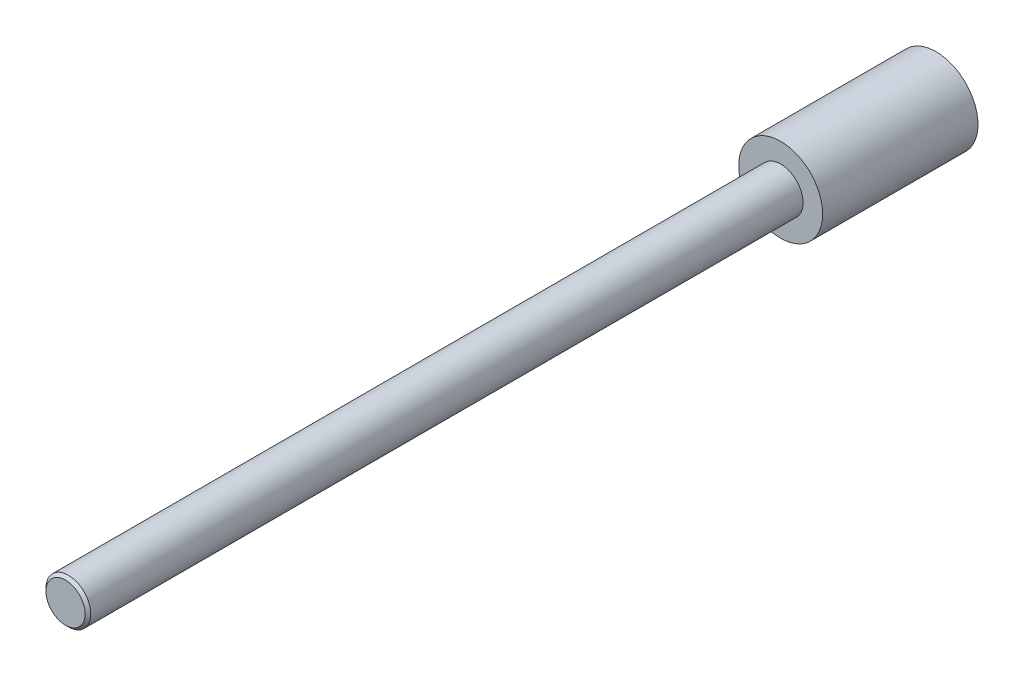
ISO-10303-21;
HEADER;
FILE_DESCRIPTION(('STEP AP214'),'2;1');
FILE_NAME('part.step','',(''),(''),'','','');
FILE_SCHEMA(('AUTOMOTIVE_DESIGN { 1 0 10303 214 1 1 1 1 }'));
ENDSEC;
DATA;
#1=APPLICATION_CONTEXT('core data for automotive mechanical design processes');
#2=APPLICATION_PROTOCOL_DEFINITION('international standard','automotive_design',2000,#1);
#3=PRODUCT_CONTEXT('',#1,'mechanical');
#4=PRODUCT('Part','Part','',(#3));
#5=PRODUCT_RELATED_PRODUCT_CATEGORY('part','',(#4));
#6=PRODUCT_DEFINITION_FORMATION('','',#4);
#7=PRODUCT_DEFINITION_CONTEXT('part definition',#1,'design');
#8=PRODUCT_DEFINITION('design','',#6,#7);
#9=PRODUCT_DEFINITION_SHAPE('','',#8);
#10=(LENGTH_UNIT() NAMED_UNIT(*) SI_UNIT(.MILLI.,.METRE.));
#11=(NAMED_UNIT(*) PLANE_ANGLE_UNIT() SI_UNIT($,.RADIAN.));
#12=(NAMED_UNIT(*) SI_UNIT($,.STERADIAN.) SOLID_ANGLE_UNIT());
#13=UNCERTAINTY_MEASURE_WITH_UNIT(LENGTH_MEASURE(1.E-05),#10,'distance_accuracy_value','');
#14=(GEOMETRIC_REPRESENTATION_CONTEXT(3) GLOBAL_UNCERTAINTY_ASSIGNED_CONTEXT((#13)) GLOBAL_UNIT_ASSIGNED_CONTEXT((#10,
#11,#12)) REPRESENTATION_CONTEXT('',''));
#15=CARTESIAN_POINT('',(0.,0.,0.));
#16=DIRECTION('',(0.,0.,1.));
#17=DIRECTION('',(1.,0.,0.));
#18=AXIS2_PLACEMENT_3D('',#15,#16,#17);
#19=CARTESIAN_POINT('',(0.,0.,13.843));
#20=DIRECTION('',(0.,0.,1.));
#21=DIRECTION('',(1.,0.,0.));
#22=AXIS2_PLACEMENT_3D('',#19,#20,#21);
#23=PLANE('',#22);
#24=CARTESIAN_POINT('',(0.,0.,13.843));
#25=DIRECTION('',(0.,0.,1.));
#26=DIRECTION('',(1.,0.,0.));
#27=AXIS2_PLACEMENT_3D('',#24,#25,#26);
#28=CIRCLE('',#27,3.81);
#29=CARTESIAN_POINT('',(3.81,0.,13.843));
#30=VERTEX_POINT('',#29);
#31=EDGE_CURVE('E48',#30,#30,#28,.T.);
#32=ORIENTED_EDGE('',*,*,#31,.T.);
#33=EDGE_LOOP('',(#32));
#34=FACE_BOUND('',#33,.T.);
#35=CARTESIAN_POINT('',(0.,0.,13.843));
#36=DIRECTION('',(0.,0.,1.));
#37=DIRECTION('',(1.,0.,0.));
#38=AXIS2_PLACEMENT_3D('',#35,#36,#37);
#39=CIRCLE('',#38,2.032);
#40=CARTESIAN_POINT('',(2.032,0.,13.843));
#41=VERTEX_POINT('',#40);
#42=EDGE_CURVE('E44',#41,#41,#39,.T.);
#43=ORIENTED_EDGE('',*,*,#42,.F.);
#44=EDGE_LOOP('',(#43));
#45=FACE_BOUND('',#44,.T.);
#46=ADVANCED_FACE('F33',(#34,#45),#23,.T.);
#47=CARTESIAN_POINT('',(0.,0.,13.843));
#48=DIRECTION('',(0.,0.,-1.));
#49=DIRECTION('',(-1.,0.,0.));
#50=AXIS2_PLACEMENT_3D('',#47,#48,#49);
#51=CYLINDRICAL_SURFACE('',#50,3.81);
#52=ORIENTED_EDGE('',*,*,#31,.F.);
#53=EDGE_LOOP('',(#52));
#54=FACE_BOUND('',#53,.T.);
#55=CARTESIAN_POINT('',(0.,0.,-0.254));
#56=DIRECTION('',(0.,0.,1.));
#57=DIRECTION('',(1.,0.,0.));
#58=AXIS2_PLACEMENT_3D('',#55,#56,#57);
#59=CIRCLE('',#58,3.81);
#60=CARTESIAN_POINT('',(3.81,0.,-0.254));
#61=VERTEX_POINT('',#60);
#62=EDGE_CURVE('E51',#61,#61,#59,.T.);
#63=ORIENTED_EDGE('',*,*,#62,.T.);
#64=EDGE_LOOP('',(#63));
#65=FACE_BOUND('',#64,.T.);
#66=ADVANCED_FACE('F59',(#54,#65),#51,.T.);
#67=CARTESIAN_POINT('',(0.,0.,-0.254));
#68=DIRECTION('',(0.,0.,1.));
#69=DIRECTION('',(1.,0.,0.));
#70=AXIS2_PLACEMENT_3D('',#67,#68,#69);
#71=PLANE('',#70);
#72=ORIENTED_EDGE('',*,*,#62,.F.);
#73=EDGE_LOOP('',(#72));
#74=FACE_BOUND('',#73,.T.);
#75=ADVANCED_FACE('F62',(#74),#71,.F.);
#76=CARTESIAN_POINT('',(0.,0.,78.74));
#77=DIRECTION('',(0.,0.,-1.));
#78=DIRECTION('',(-1.,0.,0.));
#79=AXIS2_PLACEMENT_3D('',#76,#77,#78);
#80=CYLINDRICAL_SURFACE('',#79,2.032);
#81=CARTESIAN_POINT('',(0.,0.,78.486));
#82=DIRECTION('',(0.,0.,1.));
#83=DIRECTION('',(1.,0.,0.));
#84=AXIS2_PLACEMENT_3D('',#81,#82,#83);
#85=CIRCLE('',#84,2.032);
#86=CARTESIAN_POINT('',(2.032,0.,78.486));
#87=VERTEX_POINT('',#86);
#88=EDGE_CURVE('E10',#87,#87,#85,.F.);
#89=ORIENTED_EDGE('',*,*,#88,.T.);
#90=EDGE_LOOP('',(#89));
#91=FACE_BOUND('',#90,.T.);
#92=ORIENTED_EDGE('',*,*,#42,.T.);
#93=EDGE_LOOP('',(#92));
#94=FACE_BOUND('',#93,.T.);
#95=ADVANCED_FACE('F67',(#91,#94),#80,.T.);
#96=CARTESIAN_POINT('',(0.,0.,78.74));
#97=DIRECTION('',(0.,0.,1.));
#98=DIRECTION('',(1.,0.,0.));
#99=AXIS2_PLACEMENT_3D('',#96,#97,#98);
#100=PLANE('',#99);
#101=CARTESIAN_POINT('',(0.,0.,78.74));
#102=DIRECTION('',(0.,0.,1.));
#103=DIRECTION('',(1.,0.,0.));
#104=AXIS2_PLACEMENT_3D('',#101,#102,#103);
#105=CIRCLE('',#104,1.778);
#106=CARTESIAN_POINT('',(1.778,0.,78.74));
#107=VERTEX_POINT('',#106);
#108=EDGE_CURVE('E40',#107,#107,#105,.T.);
#109=ORIENTED_EDGE('',*,*,#108,.T.);
#110=EDGE_LOOP('',(#109));
#111=FACE_BOUND('',#110,.T.);
#112=ADVANCED_FACE('F72',(#111),#100,.T.);
#113=CARTESIAN_POINT('',(0.,0.,78.74));
#114=DIRECTION('',(0.,0.,-1.));
#115=DIRECTION('',(-1.,0.,0.));
#116=AXIS2_PLACEMENT_3D('',#113,#114,#115);
#117=CONICAL_SURFACE('',#116,1.778,0.785398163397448);
#118=ORIENTED_EDGE('',*,*,#88,.F.);
#119=EDGE_LOOP('',(#118));
#120=FACE_BOUND('',#119,.T.);
#121=ORIENTED_EDGE('',*,*,#108,.F.);
#122=EDGE_LOOP('',(#121));
#123=FACE_BOUND('',#122,.T.);
#124=ADVANCED_FACE('F35',(#120,#123),#117,.T.);
#125=CLOSED_SHELL('',(#46,#66,#75,#95,#112,#124));
#126=MANIFOLD_SOLID_BREP('B2',#125);
#127=ADVANCED_BREP_SHAPE_REPRESENTATION('',(#18,#126),#14);
#128=SHAPE_DEFINITION_REPRESENTATION(#9,#127);
ENDSEC;
END-ISO-10303-21;
